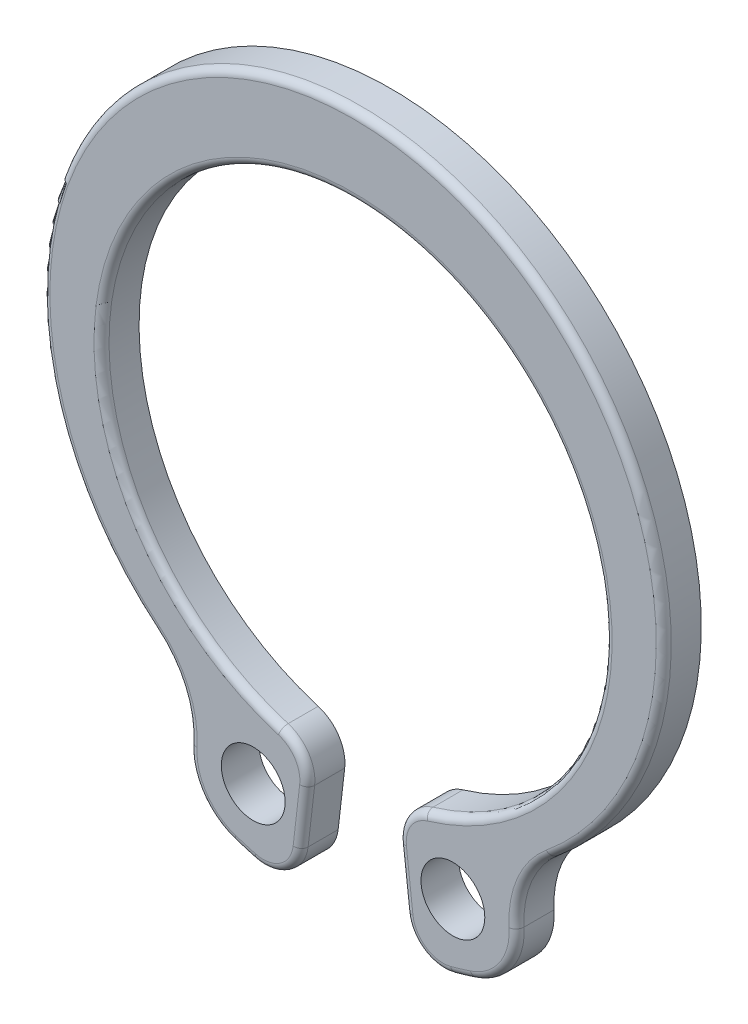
from build123d import *

# Parameters (mm, degrees)
ESQUISSE1_R          = 0.85
BASE_EXTRUSION_DEPTH = 1
CONG_1_R             = 1
CONG_2_R             = 0.2


with BuildPart() as part:
    # Esquisse1 → Base-Extrusion (new body)
    with BuildSketch(Plane.XY):
        with BuildLine():
            Line((1.120269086, -6.605679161), (1.522771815, -10.082458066))
            ThreePointArc((1.522771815, -10.082458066), (2.365192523, -9.918702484), (3.190859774, -9.684689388))
            ThreePointArc((3.190859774, -9.684689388), (4.065569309, -9.024654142), (4.355816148, -7.967999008))
            ThreePointArc((4.355816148, -7.967999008), (4.562271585, -6.7990995), (5.275525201, -5.850300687))
            ThreePointArc((5.275525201, -5.850300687), (0, 8.8), (-5.275525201, -5.850300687))
            ThreePointArc((-5.275525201, -5.850300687), (-4.562271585, -6.7990995), (-4.355816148, -7.967999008))
            ThreePointArc((-4.355816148, -7.967999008), (-4.065569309, -9.024654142), (-3.190859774, -9.684689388))
            ThreePointArc((-3.190859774, -9.684689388), (-2.365192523, -9.918702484), (-1.522771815, -10.082458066))
            Line((-1.522771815, -10.082458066), (-1.120269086, -6.605679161))
            ThreePointArc((-1.120269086, -6.605679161), (0, 6.7), (1.120269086, -6.605679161))
        make_face()
        with Locations((2.658883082, -8.070068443)):
            Circle(ESQUISSE1_R, mode=Mode.SUBTRACT)
        with Locations(Location((-2.658883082, -8.070068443, 0), (0, 0, 180))):
            Circle(ESQUISSE1_R, mode=Mode.SUBTRACT)
    extrude(amount=BASE_EXTRUSION_DEPTH)

    # Cong_1
    cong_1_edges = [part.edges().sort_by_distance(p)[0] for p in [
        (-1.120269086, -6.605679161, 0.5),
        (-1.522771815, -10.082458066, 0.5),
        (1.522771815, -10.082458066, 0.5),
        (1.120269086, -6.605679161, 0.5),
    ]]
    fillet(cong_1_edges, radius=CONG_1_R)

    # Cong_2
    cong_2_edges = [part.edges().sort_by_distance(p)[0] for p in [
        (4.065569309, -9.024654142, 1),
        (4.562271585, -6.7990995, 1),
        (0, 8.8, 1),
        (-4.562271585, -6.7990995, 1),
        (-4.065569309, -9.024654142, 1),
        (-2.92166737, -9.769270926, 1),
        (2.92166737, -9.769270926, 1),
        (1.309761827, -8.242498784, 1),
        (0, 6.7, 1),
        (-1.309761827, -8.242498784, 1),
        (-1.380458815, -6.824716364, 1),
        (1.380458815, -6.824716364, 1),
        (-1.828738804, -9.70815397, 1),
        (1.828738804, -9.70815397, 1),
    ]]
    fillet(cong_2_edges, radius=CONG_2_R)


solid = part.part
